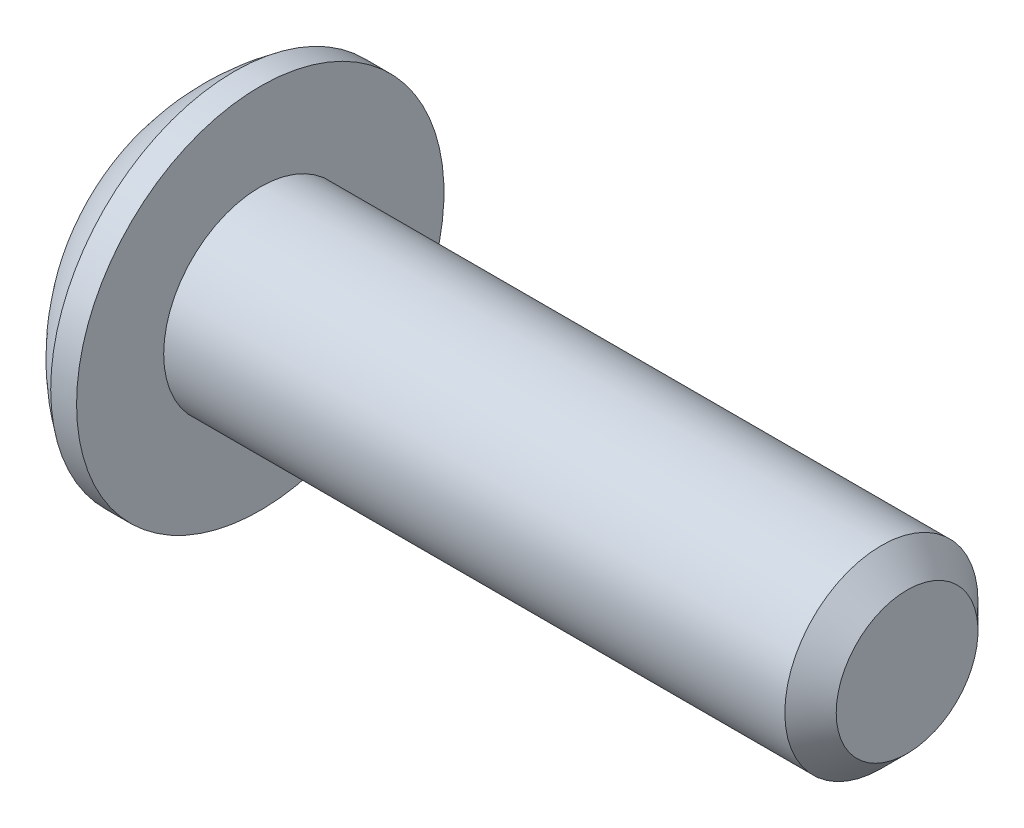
ISO-10303-21;
HEADER;
FILE_DESCRIPTION(('STEP AP214'),'2;1');
FILE_NAME('part.step','',(''),(''),'','','');
FILE_SCHEMA(('AUTOMOTIVE_DESIGN { 1 0 10303 214 1 1 1 1 }'));
ENDSEC;
DATA;
#1=APPLICATION_CONTEXT('core data for automotive mechanical design processes');
#2=APPLICATION_PROTOCOL_DEFINITION('international standard','automotive_design',2000,#1);
#3=PRODUCT_CONTEXT('',#1,'mechanical');
#4=PRODUCT('Part','Part','',(#3));
#5=PRODUCT_RELATED_PRODUCT_CATEGORY('part','',(#4));
#6=PRODUCT_DEFINITION_FORMATION('','',#4);
#7=PRODUCT_DEFINITION_CONTEXT('part definition',#1,'design');
#8=PRODUCT_DEFINITION('design','',#6,#7);
#9=PRODUCT_DEFINITION_SHAPE('','',#8);
#10=(LENGTH_UNIT() NAMED_UNIT(*) SI_UNIT(.MILLI.,.METRE.));
#11=(NAMED_UNIT(*) PLANE_ANGLE_UNIT() SI_UNIT($,.RADIAN.));
#12=(NAMED_UNIT(*) SI_UNIT($,.STERADIAN.) SOLID_ANGLE_UNIT());
#13=UNCERTAINTY_MEASURE_WITH_UNIT(LENGTH_MEASURE(1.E-05),#10,'distance_accuracy_value','');
#14=(GEOMETRIC_REPRESENTATION_CONTEXT(3) GLOBAL_UNCERTAINTY_ASSIGNED_CONTEXT((#13)) GLOBAL_UNIT_ASSIGNED_CONTEXT((#10,
#11,#12)) REPRESENTATION_CONTEXT('',''));
#15=CARTESIAN_POINT('',(0.,0.,0.));
#16=DIRECTION('',(0.,0.,1.));
#17=DIRECTION('',(1.,0.,0.));
#18=AXIS2_PLACEMENT_3D('',#15,#16,#17);
#19=CARTESIAN_POINT('',(0.,0.,0.));
#20=DIRECTION('',(-1.,0.,0.));
#21=DIRECTION('',(0.,0.,1.));
#22=AXIS2_PLACEMENT_3D('',#19,#20,#21);
#23=PLANE('',#22);
#24=CARTESIAN_POINT('',(0.,0.,0.));
#25=DIRECTION('',(-1.,0.,0.));
#26=DIRECTION('',(0.,0.,1.));
#27=AXIS2_PLACEMENT_3D('',#24,#25,#26);
#28=CIRCLE('',#27,1.35255);
#29=CARTESIAN_POINT('',(0.,1.35255,0.));
#30=VERTEX_POINT('',#29);
#31=EDGE_CURVE('E11',#30,#30,#28,.T.);
#32=ORIENTED_EDGE('',*,*,#31,.T.);
#33=EDGE_LOOP('',(#32));
#34=FACE_BOUND('',#33,.T.);
#35=DIRECTION('',(0.,-1.,0.));
#36=VECTOR('',#35,1.);
#37=CARTESIAN_POINT('',(0.,-0.454605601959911,0.787400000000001));
#38=LINE('',#37,#36);
#39=CARTESIAN_POINT('',(0.,0.454605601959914,0.787400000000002));
#40=VERTEX_POINT('',#39);
#41=CARTESIAN_POINT('',(0.,-0.454605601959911,0.787400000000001));
#42=VERTEX_POINT('',#41);
#43=EDGE_CURVE('E45',#40,#42,#38,.T.);
#44=ORIENTED_EDGE('',*,*,#43,.T.);
#45=DIRECTION('',(0.,-0.499999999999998,-0.86602540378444));
#46=VECTOR('',#45,1.);
#47=CARTESIAN_POINT('',(0.,-0.90921120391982,0.));
#48=LINE('',#47,#46);
#49=CARTESIAN_POINT('',(0.,-0.90921120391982,0.));
#50=VERTEX_POINT('',#49);
#51=EDGE_CURVE('E102',#42,#50,#48,.T.);
#52=ORIENTED_EDGE('',*,*,#51,.T.);
#53=DIRECTION('',(0.,0.499999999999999,-0.866025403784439));
#54=VECTOR('',#53,1.);
#55=CARTESIAN_POINT('',(0.,-0.454605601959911,-0.7874));
#56=LINE('',#55,#54);
#57=CARTESIAN_POINT('',(0.,-0.454605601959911,-0.7874));
#58=VERTEX_POINT('',#57);
#59=EDGE_CURVE('E104',#50,#58,#56,.T.);
#60=ORIENTED_EDGE('',*,*,#59,.T.);
#61=DIRECTION('',(0.,1.,0.));
#62=VECTOR('',#61,1.);
#63=CARTESIAN_POINT('',(0.,0.454605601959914,-0.7874));
#64=LINE('',#63,#62);
#65=CARTESIAN_POINT('',(0.,0.454605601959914,-0.7874));
#66=VERTEX_POINT('',#65);
#67=EDGE_CURVE('E116',#58,#66,#64,.T.);
#68=ORIENTED_EDGE('',*,*,#67,.T.);
#69=DIRECTION('',(0.,0.5,0.866025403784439));
#70=VECTOR('',#69,1.);
#71=CARTESIAN_POINT('',(0.,0.909211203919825,0.));
#72=LINE('',#71,#70);
#73=CARTESIAN_POINT('',(0.,0.909211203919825,0.));
#74=VERTEX_POINT('',#73);
#75=EDGE_CURVE('E372',#66,#74,#72,.T.);
#76=ORIENTED_EDGE('',*,*,#75,.T.);
#77=DIRECTION('',(0.,-0.499999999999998,0.86602540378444));
#78=VECTOR('',#77,1.);
#79=CARTESIAN_POINT('',(0.,0.454605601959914,0.787400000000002));
#80=LINE('',#79,#78);
#81=EDGE_CURVE('E375',#74,#40,#80,.T.);
#82=ORIENTED_EDGE('',*,*,#81,.T.);
#83=EDGE_LOOP('',(#44,#52,#60,#68,#76,#82));
#84=FACE_BOUND('',#83,.T.);
#85=ADVANCED_FACE('F31',(#34,#84),#23,.T.);
#86=CARTESIAN_POINT('',(3.01413934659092,0.,0.));
#87=DIRECTION('',(-1.,0.,0.));
#88=DIRECTION('',(0.,1.,0.));
#89=AXIS2_PLACEMENT_3D('',#86,#87,#88);
#90=SPHERICAL_SURFACE('',#89,3.30369906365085);
#91=CARTESIAN_POINT('',(1.1176,0.,0.));
#92=DIRECTION('',(-1.,0.,0.));
#93=DIRECTION('',(0.,0.,1.));
#94=AXIS2_PLACEMENT_3D('',#91,#92,#93);
#95=CIRCLE('',#94,2.7051);
#96=CARTESIAN_POINT('',(1.1176,2.7051,0.));
#97=VERTEX_POINT('',#96);
#98=EDGE_CURVE('E38',#97,#97,#95,.T.);
#99=CARTESIAN_POINT('',(1.1176,2.7051,0.));
#100=CARTESIAN_POINT('',(1.10245333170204,2.69448072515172,0.));
#101=CARTESIAN_POINT('',(1.08739587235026,2.68373420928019,0.));
#102=CARTESIAN_POINT('',(1.05746357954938,2.6619897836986,0.));
#103=CARTESIAN_POINT('',(1.04258874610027,2.65099187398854,0.));
#104=CARTESIAN_POINT('',(1.01302591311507,2.62874774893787,0.));
#105=CARTESIAN_POINT('',(0.998337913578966,2.61750153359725,0.));
#106=CARTESIAN_POINT('',(0.96915288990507,2.59476397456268,0.));
#107=CARTESIAN_POINT('',(0.954655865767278,2.58327263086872,0.));
#108=CARTESIAN_POINT('',(0.925856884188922,2.56004805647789,0.));
#109=CARTESIAN_POINT('',(0.911554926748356,2.54831482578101,0.));
#110=CARTESIAN_POINT('',(0.88315011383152,2.52460978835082,0.));
#111=CARTESIAN_POINT('',(0.86904725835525,2.51263798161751,0.));
#112=CARTESIAN_POINT('',(0.841044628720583,2.48845917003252,0.));
#113=CARTESIAN_POINT('',(0.827144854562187,2.47625216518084,0.));
#114=CARTESIAN_POINT('',(0.799552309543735,2.45160640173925,0.));
#115=CARTESIAN_POINT('',(0.78585953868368,2.43916764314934,0.));
#116=CARTESIAN_POINT('',(0.758684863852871,2.41406188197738,0.));
#117=CARTESIAN_POINT('',(0.745202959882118,2.40139487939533,0.));
#118=CARTESIAN_POINT('',(0.71845382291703,2.37583620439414,0.));
#119=CARTESIAN_POINT('',(0.705186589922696,2.36294453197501,0.));
#120=CARTESIAN_POINT('',(0.678870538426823,2.3369401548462,0.));
#121=CARTESIAN_POINT('',(0.665821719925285,2.32382745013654,0.));
#122=CARTESIAN_POINT('',(0.639946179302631,2.2973847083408,0.));
#123=CARTESIAN_POINT('',(0.627119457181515,2.28405467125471,0.));
#124=CARTESIAN_POINT('',(0.601691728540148,2.25718102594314,0.));
#125=CARTESIAN_POINT('',(0.589090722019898,2.24363741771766,0.));
#126=CARTESIAN_POINT('',(0.564117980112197,2.21634045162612,0.));
#127=CARTESIAN_POINT('',(0.551746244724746,2.20258709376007,0.));
#128=CARTESIAN_POINT('',(0.52723553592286,2.17487450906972,0.));
#129=CARTESIAN_POINT('',(0.515096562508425,2.16091528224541,0.));
#130=CARTESIAN_POINT('',(0.491054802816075,2.13279489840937,0.));
#131=CARTESIAN_POINT('',(0.47915201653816,2.11863374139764,0.));
#132=CARTESIAN_POINT('',(0.455585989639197,2.09011349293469,0.));
#133=CARTESIAN_POINT('',(0.443922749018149,2.07575440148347,0.));
#134=CARTESIAN_POINT('',(0.420839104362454,2.04684233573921,0.));
#135=CARTESIAN_POINT('',(0.409418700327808,2.03228936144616,0.));
#136=CARTESIAN_POINT('',(0.386823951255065,2.00299363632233,0.));
#137=CARTESIAN_POINT('',(0.375649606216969,1.98825088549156,0.));
#138=CARTESIAN_POINT('',(0.353550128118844,1.95857976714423,0.));
#139=CARTESIAN_POINT('',(0.342624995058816,1.94365139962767,0.));
#140=CARTESIAN_POINT('',(0.321027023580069,1.91361326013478,0.));
#141=CARTESIAN_POINT('',(0.310354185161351,1.89850348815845,0.));
#142=CARTESIAN_POINT('',(0.289263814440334,1.86810680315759,0.));
#143=CARTESIAN_POINT('',(0.278846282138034,1.85281989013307,0.));
#144=CARTESIAN_POINT('',(0.258269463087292,1.82207323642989,0.));
#145=CARTESIAN_POINT('',(0.24811017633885,1.80661349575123,0.));
#146=CARTESIAN_POINT('',(0.228052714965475,1.77552554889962,0.));
#147=CARTESIAN_POINT('',(0.218154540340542,1.75989734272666,0.));
#148=CARTESIAN_POINT('',(0.19862209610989,1.72847687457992,0.));
#149=CARTESIAN_POINT('',(0.18898782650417,1.71268461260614,0.));
#150=CARTESIAN_POINT('',(0.169985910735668,1.68094048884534,0.));
#151=CARTESIAN_POINT('',(0.160618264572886,1.66498862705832,0.));
#152=CARTESIAN_POINT('',(0.14215223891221,1.63292980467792,0.));
#153=CARTESIAN_POINT('',(0.133053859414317,1.61682284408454,0.));
#154=CARTESIAN_POINT('',(0.115128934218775,1.58445836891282,0.));
#155=CARTESIAN_POINT('',(0.106302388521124,1.56820085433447,0.));
#156=CARTESIAN_POINT('',(0.0889236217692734,1.53553985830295,0.));
#157=CARTESIAN_POINT('',(0.0803714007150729,1.51913637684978,0.));
#158=CARTESIAN_POINT('',(0.0635436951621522,1.48618807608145,0.));
#159=CARTESIAN_POINT('',(0.055268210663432,1.46964325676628,0.));
#160=CARTESIAN_POINT('',(0.0389963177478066,1.43641694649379,0.));
#161=CARTESIAN_POINT('',(0.0309999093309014,1.41973545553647,0.));
#162=CARTESIAN_POINT('',(0.015288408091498,1.38624051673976,0.));
#163=CARTESIAN_POINT('',(0.00757331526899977,1.36942706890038,0.));
#164=CARTESIAN_POINT('',(0.,1.35255,0.));
#165=B_SPLINE_CURVE_WITH_KNOTS('',3,(#99,#100,#101,#102,#103,#104,#105,#106,#107,#108,#109,#110,
#111,#112,#113,#114,#115,#116,#117,#118,#119,#120,#121,#122,#123,#124,#125,#126,#127,#128,#129,
#130,#131,#132,#133,#134,#135,#136,#137,#138,#139,#140,#141,#142,#143,#144,#145,#146,#147,#148,
#149,#150,#151,#152,#153,#154,#155,#156,#157,#158,#159,#160,#161,#162,#163,#164),.UNSPECIFIED.,
.F.,.F.,(4,2,2,2,2,2,2,2,2,2,2,2,2,2,2,2,2,2,2,2,2,2,2,2,2,2,2,2,2,2,2,2,4),(0.,
0.0554945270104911,0.110989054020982,0.166483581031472,0.221978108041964,0.277472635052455,
0.332967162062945,0.388461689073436,0.443956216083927,0.499450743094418,0.554945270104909,
0.6104397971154,0.66593432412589,0.721428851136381,0.776923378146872,0.832417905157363,
0.887912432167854,0.943406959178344,0.998901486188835,1.05439601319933,1.10989054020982,
1.16538506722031,1.2208795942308,1.27637412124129,1.33186864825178,1.38736317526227,
1.44285770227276,1.49835222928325,1.55384675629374,1.60934128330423,1.66483581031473,
1.72033033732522,1.77582486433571),.UNSPECIFIED.);
#166=EDGE_CURVE('BSEAM148',#97,#30,#165,.T.);
#167=ORIENTED_EDGE('',*,*,#98,.T.);
#168=ORIENTED_EDGE('',*,*,#31,.F.);
#169=ORIENTED_EDGE('',*,*,#166,.T.);
#170=ORIENTED_EDGE('',*,*,#166,.F.);
#171=EDGE_LOOP('',(#167,#169,#168,#170));
#172=FACE_BOUND('',#171,.T.);
#173=ADVANCED_FACE('F148',(#172),#90,.T.);
#174=CARTESIAN_POINT('',(0.,0.,0.));
#175=DIRECTION('',(-1.,0.,0.));
#176=DIRECTION('',(0.,0.,1.));
#177=AXIS2_PLACEMENT_3D('',#174,#175,#176);
#178=CYLINDRICAL_SURFACE('',#177,2.7051);
#179=ORIENTED_EDGE('',*,*,#98,.F.);
#180=EDGE_LOOP('',(#179));
#181=FACE_BOUND('',#180,.T.);
#182=CARTESIAN_POINT('',(1.4986,0.,0.));
#183=DIRECTION('',(-1.,0.,0.));
#184=DIRECTION('',(0.,0.,1.));
#185=AXIS2_PLACEMENT_3D('',#182,#183,#184);
#186=CIRCLE('',#185,2.7051);
#187=CARTESIAN_POINT('',(1.4986,0.,2.7051));
#188=VERTEX_POINT('',#187);
#189=EDGE_CURVE('E143',#188,#188,#186,.T.);
#190=ORIENTED_EDGE('',*,*,#189,.T.);
#191=EDGE_LOOP('',(#190));
#192=FACE_BOUND('',#191,.T.);
#193=ADVANCED_FACE('F151',(#181,#192),#178,.T.);
#194=CARTESIAN_POINT('',(1.4986,1.42239999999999,0.));
#195=DIRECTION('',(-1.,0.,0.));
#196=DIRECTION('',(0.,0.,1.));
#197=AXIS2_PLACEMENT_3D('',#194,#195,#196);
#198=PLANE('',#197);
#199=ORIENTED_EDGE('',*,*,#189,.F.);
#200=EDGE_LOOP('',(#199));
#201=FACE_BOUND('',#200,.T.);
#202=CARTESIAN_POINT('',(1.4986,0.,0.));
#203=DIRECTION('',(-1.,0.,0.));
#204=DIRECTION('',(0.,0.,1.));
#205=AXIS2_PLACEMENT_3D('',#202,#203,#204);
#206=CIRCLE('',#205,1.42239999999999);
#207=CARTESIAN_POINT('',(1.4986,0.,1.42239999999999));
#208=VERTEX_POINT('',#207);
#209=EDGE_CURVE('E140',#208,#208,#206,.T.);
#210=ORIENTED_EDGE('',*,*,#209,.T.);
#211=EDGE_LOOP('',(#210));
#212=FACE_BOUND('',#211,.T.);
#213=ADVANCED_FACE('F154',(#201,#212),#198,.F.);
#214=CARTESIAN_POINT('',(0.,0.,0.));
#215=DIRECTION('',(-1.,0.,0.));
#216=DIRECTION('',(0.,0.,1.));
#217=AXIS2_PLACEMENT_3D('',#214,#215,#216);
#218=CYLINDRICAL_SURFACE('',#217,1.4224);
#219=ORIENTED_EDGE('',*,*,#209,.F.);
#220=EDGE_LOOP('',(#219));
#221=FACE_BOUND('',#220,.T.);
#222=CARTESIAN_POINT('',(10.64514,0.,0.));
#223=DIRECTION('',(-1.,0.,0.));
#224=DIRECTION('',(0.,0.,1.));
#225=AXIS2_PLACEMENT_3D('',#222,#223,#224);
#226=CIRCLE('',#225,1.4224);
#227=CARTESIAN_POINT('',(10.64514,0.,1.4224));
#228=VERTEX_POINT('',#227);
#229=EDGE_CURVE('E137',#228,#228,#226,.T.);
#230=ORIENTED_EDGE('',*,*,#229,.T.);
#231=EDGE_LOOP('',(#230));
#232=FACE_BOUND('',#231,.T.);
#233=ADVANCED_FACE('F160',(#221,#232),#218,.T.);
#234=CARTESIAN_POINT('',(11.0236,0.,0.));
#235=DIRECTION('',(-1.,0.,0.));
#236=DIRECTION('',(0.,0.,1.));
#237=AXIS2_PLACEMENT_3D('',#234,#235,#236);
#238=CONICAL_SURFACE('',#237,1.04394,0.785398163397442);
#239=ORIENTED_EDGE('',*,*,#229,.F.);
#240=EDGE_LOOP('',(#239));
#241=FACE_BOUND('',#240,.T.);
#242=CARTESIAN_POINT('',(11.0236,0.,0.));
#243=DIRECTION('',(-1.,0.,0.));
#244=DIRECTION('',(0.,0.,1.));
#245=AXIS2_PLACEMENT_3D('',#242,#243,#244);
#246=CIRCLE('',#245,1.04394);
#247=CARTESIAN_POINT('',(11.0236,0.,1.04394));
#248=VERTEX_POINT('',#247);
#249=EDGE_CURVE('E133',#248,#248,#246,.T.);
#250=ORIENTED_EDGE('',*,*,#249,.T.);
#251=EDGE_LOOP('',(#250));
#252=FACE_BOUND('',#251,.T.);
#253=ADVANCED_FACE('F166',(#241,#252),#238,.T.);
#254=CARTESIAN_POINT('',(11.0236,0.,0.));
#255=DIRECTION('',(-1.,0.,0.));
#256=DIRECTION('',(0.,0.,1.));
#257=AXIS2_PLACEMENT_3D('',#254,#255,#256);
#258=PLANE('',#257);
#259=ORIENTED_EDGE('',*,*,#249,.F.);
#260=EDGE_LOOP('',(#259));
#261=FACE_BOUND('',#260,.T.);
#262=ADVANCED_FACE('F172',(#261),#258,.F.);
#263=CARTESIAN_POINT('',(0.889,-0.90921120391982,0.));
#264=DIRECTION('',(0.,0.86602540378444,-0.499999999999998));
#265=DIRECTION('',(0.,0.499999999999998,0.86602540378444));
#266=AXIS2_PLACEMENT_3D('',#263,#264,#265);
#267=PLANE('',#266);
#268=DIRECTION('',(0.,-0.499999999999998,-0.86602540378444));
#269=VECTOR('',#268,1.);
#270=CARTESIAN_POINT('',(0.889,-0.90921120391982,0.));
#271=LINE('',#270,#269);
#272=CARTESIAN_POINT('',(0.889,-0.454605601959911,0.787400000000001));
#273=VERTEX_POINT('',#272);
#274=CARTESIAN_POINT('',(0.889,-0.681908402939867,0.393699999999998));
#275=VERTEX_POINT('',#274);
#276=EDGE_CURVE('E350',#273,#275,#271,.T.);
#277=ORIENTED_EDGE('',*,*,#276,.T.);
#278=CARTESIAN_POINT('',(0.889,-0.90921120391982,0.));
#279=VERTEX_POINT('',#278);
#280=EDGE_CURVE('E121',#275,#279,#271,.T.);
#281=ORIENTED_EDGE('',*,*,#280,.T.);
#282=DIRECTION('',(-1.,0.,0.));
#283=VECTOR('',#282,1.);
#284=CARTESIAN_POINT('',(0.889,-0.90921120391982,0.));
#285=LINE('',#284,#283);
#286=EDGE_CURVE('E112',#279,#50,#285,.T.);
#287=ORIENTED_EDGE('',*,*,#286,.T.);
#288=ORIENTED_EDGE('',*,*,#51,.F.);
#289=DIRECTION('',(-1.,0.,0.));
#290=VECTOR('',#289,1.);
#291=CARTESIAN_POINT('',(0.889,-0.454605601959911,0.787400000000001));
#292=LINE('',#291,#290);
#293=EDGE_CURVE('E356',#273,#42,#292,.T.);
#294=ORIENTED_EDGE('',*,*,#293,.F.);
#295=EDGE_LOOP('',(#277,#281,#287,#288,#294));
#296=FACE_BOUND('',#295,.T.);
#297=ADVANCED_FACE('F119',(#296),#267,.T.);
#298=CARTESIAN_POINT('',(0.889,-0.454605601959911,-0.7874));
#299=DIRECTION('',(0.,0.866025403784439,0.499999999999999));
#300=DIRECTION('',(0.,-0.499999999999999,0.866025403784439));
#301=AXIS2_PLACEMENT_3D('',#298,#299,#300);
#302=PLANE('',#301);
#303=DIRECTION('',(0.,0.499999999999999,-0.866025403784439));
#304=VECTOR('',#303,1.);
#305=CARTESIAN_POINT('',(0.889,-0.454605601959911,-0.7874));
#306=LINE('',#305,#304);
#307=CARTESIAN_POINT('',(0.889,-0.681908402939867,-0.393699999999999));
#308=VERTEX_POINT('',#307);
#309=EDGE_CURVE('E53',#279,#308,#306,.T.);
#310=ORIENTED_EDGE('',*,*,#309,.T.);
#311=CARTESIAN_POINT('',(0.889,-0.454605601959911,-0.7874));
#312=VERTEX_POINT('',#311);
#313=EDGE_CURVE('E382',#308,#312,#306,.T.);
#314=ORIENTED_EDGE('',*,*,#313,.T.);
#315=DIRECTION('',(-1.,0.,0.));
#316=VECTOR('',#315,1.);
#317=CARTESIAN_POINT('',(0.889,-0.454605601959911,-0.7874));
#318=LINE('',#317,#316);
#319=EDGE_CURVE('E114',#312,#58,#318,.T.);
#320=ORIENTED_EDGE('',*,*,#319,.T.);
#321=ORIENTED_EDGE('',*,*,#59,.F.);
#322=ORIENTED_EDGE('',*,*,#286,.F.);
#323=EDGE_LOOP('',(#310,#314,#320,#321,#322));
#324=FACE_BOUND('',#323,.T.);
#325=ADVANCED_FACE('F111',(#324),#302,.T.);
#326=CARTESIAN_POINT('',(0.889,0.454605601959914,-0.7874));
#327=DIRECTION('',(0.,0.,1.));
#328=DIRECTION('',(1.,0.,0.));
#329=AXIS2_PLACEMENT_3D('',#326,#327,#328);
#330=PLANE('',#329);
#331=DIRECTION('',(0.,1.,0.));
#332=VECTOR('',#331,1.);
#333=CARTESIAN_POINT('',(0.889,0.454605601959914,-0.7874));
#334=LINE('',#333,#332);
#335=CARTESIAN_POINT('',(0.889,0.,-0.7874));
#336=VERTEX_POINT('',#335);
#337=EDGE_CURVE('E384',#312,#336,#334,.T.);
#338=ORIENTED_EDGE('',*,*,#337,.T.);
#339=CARTESIAN_POINT('',(0.889,0.454605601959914,-0.7874));
#340=VERTEX_POINT('',#339);
#341=EDGE_CURVE('E369',#336,#340,#334,.T.);
#342=ORIENTED_EDGE('',*,*,#341,.T.);
#343=DIRECTION('',(-1.,0.,0.));
#344=VECTOR('',#343,1.);
#345=CARTESIAN_POINT('',(0.889,0.454605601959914,-0.7874));
#346=LINE('',#345,#344);
#347=EDGE_CURVE('E128',#340,#66,#346,.T.);
#348=ORIENTED_EDGE('',*,*,#347,.T.);
#349=ORIENTED_EDGE('',*,*,#67,.F.);
#350=ORIENTED_EDGE('',*,*,#319,.F.);
#351=EDGE_LOOP('',(#338,#342,#348,#349,#350));
#352=FACE_BOUND('',#351,.T.);
#353=ADVANCED_FACE('F231',(#352),#330,.T.);
#354=CARTESIAN_POINT('',(0.889,0.909211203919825,0.));
#355=DIRECTION('',(0.,-0.866025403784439,0.5));
#356=DIRECTION('',(0.,-0.5,-0.866025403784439));
#357=AXIS2_PLACEMENT_3D('',#354,#355,#356);
#358=PLANE('',#357);
#359=DIRECTION('',(0.,0.5,0.866025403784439));
#360=VECTOR('',#359,1.);
#361=CARTESIAN_POINT('',(0.889,0.909211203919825,0.));
#362=LINE('',#361,#360);
#363=CARTESIAN_POINT('',(0.889,0.681908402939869,-0.393700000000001));
#364=VERTEX_POINT('',#363);
#365=EDGE_CURVE('E386',#340,#364,#362,.T.);
#366=ORIENTED_EDGE('',*,*,#365,.T.);
#367=CARTESIAN_POINT('',(0.889,0.909211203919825,0.));
#368=VERTEX_POINT('',#367);
#369=EDGE_CURVE('E385',#364,#368,#362,.T.);
#370=ORIENTED_EDGE('',*,*,#369,.T.);
#371=DIRECTION('',(-1.,0.,0.));
#372=VECTOR('',#371,1.);
#373=CARTESIAN_POINT('',(0.889,0.909211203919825,0.));
#374=LINE('',#373,#372);
#375=EDGE_CURVE('E362',#368,#74,#374,.T.);
#376=ORIENTED_EDGE('',*,*,#375,.T.);
#377=ORIENTED_EDGE('',*,*,#75,.F.);
#378=ORIENTED_EDGE('',*,*,#347,.F.);
#379=EDGE_LOOP('',(#366,#370,#376,#377,#378));
#380=FACE_BOUND('',#379,.T.);
#381=ADVANCED_FACE('F240',(#380),#358,.T.);
#382=CARTESIAN_POINT('',(0.889,0.454605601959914,0.787400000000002));
#383=DIRECTION('',(0.,-0.86602540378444,-0.499999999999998));
#384=DIRECTION('',(0.,0.499999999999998,-0.86602540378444));
#385=AXIS2_PLACEMENT_3D('',#382,#383,#384);
#386=PLANE('',#385);
#387=DIRECTION('',(0.,-0.499999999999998,0.86602540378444));
#388=VECTOR('',#387,1.);
#389=CARTESIAN_POINT('',(0.889,0.454605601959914,0.787400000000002));
#390=LINE('',#389,#388);
#391=CARTESIAN_POINT('',(0.889,0.68190840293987,0.3937));
#392=VERTEX_POINT('',#391);
#393=EDGE_CURVE('E351',#368,#392,#390,.T.);
#394=ORIENTED_EDGE('',*,*,#393,.T.);
#395=CARTESIAN_POINT('',(0.889,0.454605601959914,0.787400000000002));
#396=VERTEX_POINT('',#395);
#397=EDGE_CURVE('E346',#392,#396,#390,.T.);
#398=ORIENTED_EDGE('',*,*,#397,.T.);
#399=DIRECTION('',(-1.,0.,0.));
#400=VECTOR('',#399,1.);
#401=CARTESIAN_POINT('',(0.889,0.454605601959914,0.787400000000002));
#402=LINE('',#401,#400);
#403=EDGE_CURVE('E355',#396,#40,#402,.T.);
#404=ORIENTED_EDGE('',*,*,#403,.T.);
#405=ORIENTED_EDGE('',*,*,#81,.F.);
#406=ORIENTED_EDGE('',*,*,#375,.F.);
#407=EDGE_LOOP('',(#394,#398,#404,#405,#406));
#408=FACE_BOUND('',#407,.T.);
#409=ADVANCED_FACE('F250',(#408),#386,.T.);
#410=CARTESIAN_POINT('',(0.889,-0.454605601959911,0.787400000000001));
#411=DIRECTION('',(0.,0.,-1.));
#412=DIRECTION('',(0.,1.,0.));
#413=AXIS2_PLACEMENT_3D('',#410,#411,#412);
#414=PLANE('',#413);
#415=DIRECTION('',(0.,-1.,0.));
#416=VECTOR('',#415,1.);
#417=CARTESIAN_POINT('',(0.889,-0.454605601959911,0.787400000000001));
#418=LINE('',#417,#416);
#419=CARTESIAN_POINT('',(0.889,0.,0.787400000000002));
#420=VERTEX_POINT('',#419);
#421=EDGE_CURVE('E345',#396,#420,#418,.T.);
#422=ORIENTED_EDGE('',*,*,#421,.T.);
#423=EDGE_CURVE('E349',#420,#273,#418,.T.);
#424=ORIENTED_EDGE('',*,*,#423,.T.);
#425=ORIENTED_EDGE('',*,*,#293,.T.);
#426=ORIENTED_EDGE('',*,*,#43,.F.);
#427=ORIENTED_EDGE('',*,*,#403,.F.);
#428=EDGE_LOOP('',(#422,#424,#425,#426,#427));
#429=FACE_BOUND('',#428,.T.);
#430=ADVANCED_FACE('F260',(#429),#414,.T.);
#431=CARTESIAN_POINT('',(0.889,-1.36381680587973,-0.7874));
#432=DIRECTION('',(1.,0.,0.));
#433=DIRECTION('',(0.,0.,-1.));
#434=AXIS2_PLACEMENT_3D('',#431,#432,#433);
#435=PLANE('',#434);
#436=CARTESIAN_POINT('',(0.889,0.,0.));
#437=DIRECTION('',(-1.,0.,0.));
#438=DIRECTION('',(0.,0.,1.));
#439=AXIS2_PLACEMENT_3D('',#436,#437,#438);
#440=CIRCLE('',#439,0.7874);
#441=EDGE_CURVE('E389',#364,#336,#440,.T.);
#442=ORIENTED_EDGE('',*,*,#441,.F.);
#443=ORIENTED_EDGE('',*,*,#365,.F.);
#444=ORIENTED_EDGE('',*,*,#341,.F.);
#445=EDGE_LOOP('',(#442,#443,#444));
#446=FACE_BOUND('',#445,.T.);
#447=ADVANCED_FACE('F270',(#446),#435,.F.);
#448=EDGE_CURVE('E134',#392,#364,#440,.T.);
#449=ORIENTED_EDGE('',*,*,#448,.F.);
#450=ORIENTED_EDGE('',*,*,#393,.F.);
#451=ORIENTED_EDGE('',*,*,#369,.F.);
#452=EDGE_LOOP('',(#449,#450,#451));
#453=FACE_BOUND('',#452,.T.);
#454=ADVANCED_FACE('F280',(#453),#435,.F.);
#455=EDGE_CURVE('E127',#420,#392,#440,.T.);
#456=ORIENTED_EDGE('',*,*,#455,.F.);
#457=ORIENTED_EDGE('',*,*,#421,.F.);
#458=ORIENTED_EDGE('',*,*,#397,.F.);
#459=EDGE_LOOP('',(#456,#457,#458));
#460=FACE_BOUND('',#459,.T.);
#461=ADVANCED_FACE('F291',(#460),#435,.F.);
#462=EDGE_CURVE('E122',#275,#420,#440,.T.);
#463=ORIENTED_EDGE('',*,*,#462,.F.);
#464=ORIENTED_EDGE('',*,*,#276,.F.);
#465=ORIENTED_EDGE('',*,*,#423,.F.);
#466=EDGE_LOOP('',(#463,#464,#465));
#467=FACE_BOUND('',#466,.T.);
#468=ADVANCED_FACE('F300',(#467),#435,.F.);
#469=EDGE_CURVE('E125',#308,#275,#440,.T.);
#470=ORIENTED_EDGE('',*,*,#469,.F.);
#471=ORIENTED_EDGE('',*,*,#309,.F.);
#472=ORIENTED_EDGE('',*,*,#280,.F.);
#473=EDGE_LOOP('',(#470,#471,#472));
#474=FACE_BOUND('',#473,.T.);
#475=ADVANCED_FACE('F309',(#474),#435,.F.);
#476=EDGE_CURVE('E390',#336,#308,#440,.T.);
#477=ORIENTED_EDGE('',*,*,#476,.F.);
#478=ORIENTED_EDGE('',*,*,#337,.F.);
#479=ORIENTED_EDGE('',*,*,#313,.F.);
#480=EDGE_LOOP('',(#477,#478,#479));
#481=FACE_BOUND('',#480,.T.);
#482=ADVANCED_FACE('F283',(#481),#435,.F.);
#483=CARTESIAN_POINT('',(1.34360560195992,0.,0.));
#484=DIRECTION('',(-1.,0.,0.));
#485=DIRECTION('',(0.,0.,1.));
#486=AXIS2_PLACEMENT_3D('',#483,#484,#485);
#487=CONICAL_SURFACE('',#486,0.,1.04719755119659);
#488=ORIENTED_EDGE('',*,*,#455,.T.);
#489=ORIENTED_EDGE('',*,*,#448,.T.);
#490=ORIENTED_EDGE('',*,*,#441,.T.);
#491=ORIENTED_EDGE('',*,*,#476,.T.);
#492=ORIENTED_EDGE('',*,*,#469,.T.);
#493=ORIENTED_EDGE('',*,*,#462,.T.);
#494=EDGE_LOOP('',(#488,#489,#490,#491,#492,#493));
#495=FACE_BOUND('',#494,.T.);
#496=CARTESIAN_POINT('',(1.34360560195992,0.,0.));
#497=VERTEX_POINT('',#496);
#498=VERTEX_LOOP('',#497);
#499=FACE_BOUND('',#498,.T.);
#500=ADVANCED_FACE('F326',(#495,#499),#487,.F.);
#501=CLOSED_SHELL('',(#85,#173,#193,#213,#233,#253,#262,#297,#325,#353,#381,#409,#430,#447,#454,
#461,#468,#475,#482,#500));
#502=MANIFOLD_SOLID_BREP('B2',#501);
#503=ADVANCED_BREP_SHAPE_REPRESENTATION('',(#18,#502),#14);
#504=SHAPE_DEFINITION_REPRESENTATION(#9,#503);
ENDSEC;
END-ISO-10303-21;
